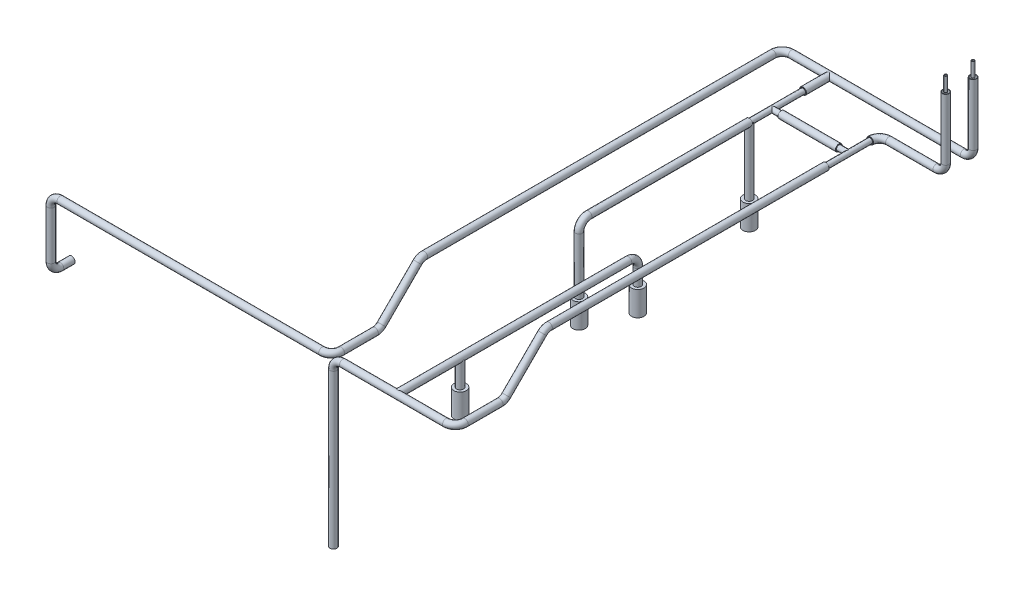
from build123d import *

# Parameters (mm, degrees)
CROQUIS19_R                   = 15
CROQUIS19_R_2                 = 10.25
SALIENTE_EXTRUIR5_DEPTH       = 150
CROQUIS21_R                   = 15
CROQUIS21_R_2                 = 10.25
SALIENTE_EXTRUIR6_DEPTH       = 150
CROQUIS1_R                    = 36.5
CROQUIS1_R_2                  = 31.75
CROQUIS9_R                    = 36.5
CROQUIS9_R_2                  = 31.75
CROQUIS23_R                   = 36.5
CROQUIS23_R_2                 = 31.75
CROQUIS24_R                   = 36.5
CROQUIS24_R_2                 = 31.75
CROQUIS25_R                   = 36.5
CROQUIS25_R_2                 = 31.75
CROQUIS26_R                   = 36.5
CROQUIS26_R_2                 = 31.75
CROQUIS8_R                    = 36.5
CROQUIS8_R_2                  = 31.75
CROQUIS16_R                   = 36.5
CROQUIS16_R_2                 = 31.75
CROQUIS14_R                   = 36.5
CROQUIS14_R_2                 = 31.75
CROQUIS18_R                   = 65.5
SALIENTE_EXTRUIR7_DEPTH       = 260
CROQUIS12_R                   = 65.5
SALIENTE_EXTRUIR8_DEPTH       = 260
CROQUIS13_R                   = 65.5
SALIENTE_EXTRUIR9_DEPTH       = 260
CROQUIS15_R                   = 65.5
SALIENTE_EXTRUIR10_DEPTH      = 260
CROQUIS27_R                   = 27
CROQUIS27_R_2                 = 24
SALIENTE_EXTRUIR12_DEPTH      = 569
CROQUIS28_R                   = 27
CROQUIS28_R_2                 = 24
SALIENTE_EXTRUIR13_DEPTH      = 99
CROQUIS29_R                   = 27
CROQUIS29_R_2                 = 24
SALIENTE_EXTRUIR14_DEPTH      = 469
SALIENTE_EXTRUIR15_DEPTH      = 5
SALIENTE_EXTRUIR15_DEPTH_BACK = 99
CROQUIS30_R                   = 27
CROQUIS30_R_2                 = 24


with BuildPart() as part:
    # Croquis19 → Saliente-Extruir5 (new body)
    with BuildSketch(Plane(origin=(4896.843322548, 3232.90277491, 1187.836422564), x_dir=(-1, 0, 0), z_dir=(0, 1, 0))):
        with Locations(Location((0, 0, 0), (0, 0, 90))):
            Circle(CROQUIS19_R)
        with Locations(Location((0, 0, 0), (0, 0, 90))):
            Circle(CROQUIS19_R_2, mode=Mode.SUBTRACT)
    extrude(amount=SALIENTE_EXTRUIR5_DEPTH)


with BuildPart() as body_2:
    # Croquis21 → Saliente-Extruir6 (new body)
    with BuildSketch(Plane(origin=(4886.843322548, 3232.90277491, 1467.836422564), x_dir=(-1, 0, 0), z_dir=(0, 1, 0))):
        with Locations(Location((0, 0, 0), (0, 0, 90))):
            Circle(CROQUIS21_R)
        with Locations(Location((0, 0, 0), (0, 0, 90))):
            Circle(CROQUIS21_R_2, mode=Mode.SUBTRACT)
    extrude(amount=SALIENTE_EXTRUIR6_DEPTH)


with BuildPart() as body_3:
    # Barrer1: sweep along a curve in space
    with BuildLine() as barrer1_path:
        Line((-93.156677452, 1334.496570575, 5736.242626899), (-93.156677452, 1334.496570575, 5856.242626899))
        ThreePointArc((-93.156677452, 1334.496570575, 5856.242626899), (-93.156677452, 1363.785892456, 5926.953305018), (-93.156677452, 1434.496570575, 5956.242626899))
        Line((-93.156677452, 1434.496570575, 5956.242626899), (-93.156677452, 1944.496570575, 5956.242626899))
        ThreePointArc((-93.156677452, 1944.496570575, 5956.242626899), (-63.867355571, 2015.207248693, 5956.242626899), (6.843322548, 2044.496570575, 5956.242626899))
        Line((6.843322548, 2044.496570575, 5956.242626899), (2776.843322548, 2044.496570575, 5956.242626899))
        ThreePointArc((2876.843322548, 2044.496570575, 5856.242626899), (2847.554000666, 2044.496570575, 5926.953305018), (2776.843322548, 2044.496570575, 5956.242626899))
        Line((2876.843322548, 2044.496570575, 5856.242626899), (2876.843322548, 2044.496570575, 5497.663983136))
        ThreePointArc((2876.843322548, 2044.496570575, 5497.663983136), (2876.843322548, 2052.108617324, 5459.3956399), (2876.843322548, 2073.785892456, 5426.953305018))
        Line((2876.843322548, 2073.785892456, 5426.953305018), (2876.843322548, 2453.613453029, 5047.125744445))
        ThreePointArc((2876.843322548, 2453.613453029, 5047.125744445), (2876.843322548, 2475.290728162, 5014.683409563), (2876.843322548, 2482.90277491, 4976.415066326))
        Line((2876.843322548, 2482.90277491, 4976.415066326), (2876.843322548, 2482.90277491, 1287.836422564))
        ThreePointArc((2876.843322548, 2482.90277491, 1287.836422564), (2906.132644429, 2482.90277491, 1217.125744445), (2976.843322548, 2482.90277491, 1187.836422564))
        Line((2976.843322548, 2482.90277491, 1187.836422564), (3376.843322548, 2482.90277491, 1187.836422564))
        Line((3376.843322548, 2482.90277491, 1187.836422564), (4796.843322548, 2482.90277491, 1187.836422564))
        ThreePointArc((4796.843322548, 2482.90277491, 1187.836422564), (4867.554000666, 2512.192096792, 1187.836422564), (4896.843322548, 2582.90277491, 1187.836422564))
        Line((4896.843322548, 2582.90277491, 1187.836422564), (4896.843322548, 3232.90277491, 1187.836422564))
    # Croquis1 → Barrer1 (sweep)
    with BuildSketch(Plane(origin=(-93.156677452, 1334.496570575, 5736.242626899), x_dir=(1, 0, 0), z_dir=(0, 0, 1))):
        Circle(CROQUIS1_R)
        Circle(CROQUIS1_R_2, mode=Mode.SUBTRACT)
    sweep(path=barrer1_path.line)

    # Barrer4: sweep along a curve in space
    with BuildLine() as barrer4_path:
        Line((3376.843322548, 2482.90277491, 1187.836422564), (3376.843322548, 2482.90277491, 1467.836422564))
    # Croquis24 → Barrer4 (sweep)
    with BuildSketch(Plane(origin=(3376.843322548, 2482.90277491, 1467.836422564), x_dir=(1, 0, 0), z_dir=(0, 0, 1))):
        Circle(CROQUIS24_R)
        Circle(CROQUIS24_R_2, mode=Mode.SUBTRACT)
    sweep(path=barrer4_path.line)


with BuildPart() as body_4:
    # Barrer2: sweep along a curve in space
    with BuildLine() as barrer2_path:
        Line((3376.843322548, 1782.90277491, 3837.836422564), (3376.843322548, 2382.90277491, 3837.836422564))
        ThreePointArc((3376.843322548, 2382.90277491, 3837.836422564), (3376.843322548, 2453.613453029, 3808.547100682), (3376.843322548, 2482.90277491, 3737.836422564))
        Line((3376.843322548, 2482.90277491, 3737.836422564), (3376.843322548, 2482.90277491, 2037.836422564))
    # Croquis9 → Barrer2 (sweep)
    with BuildSketch(Plane(origin=(3376.843322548, 1782.90277491, 3837.836422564), x_dir=(1, 0, 0), z_dir=(0, -1, 0))):
        Circle(CROQUIS9_R)
        Circle(CROQUIS9_R_2, mode=Mode.SUBTRACT)
    sweep(path=barrer2_path.line)

    # Barrer8: sweep along a curve in space
    with BuildLine() as barrer8_path:
        Line((3376.843322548, 2482.90277491, 2037.836422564), (3376.843322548, 1782.90277491, 2037.836422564))
    # Croquis16 → Barrer8 (sweep)
    with BuildSketch(Plane(origin=(3376.843322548, 1782.90277491, 2037.836422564), x_dir=(1, 0, 0), z_dir=(0, -1, 0))):
        Circle(CROQUIS16_R)
        Circle(CROQUIS16_R_2, mode=Mode.SUBTRACT)
    sweep(path=barrer8_path.line)

    # Croquis18 → Saliente-Extruir7 (add)
    with BuildSketch(Plane(origin=(3376.843322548, 1782.90277491, 2037.836422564), x_dir=(1, 0, 0), z_dir=(0, -1, 0))):
        with Locations(Location((0, 0, 0), (0, 0, 270))):
            Circle(CROQUIS18_R)
    extrude(amount=SALIENTE_EXTRUIR7_DEPTH)

    # Croquis13 → Saliente-Extruir9 (add)
    with BuildSketch(Plane(origin=(3376.843322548, 1782.90277491, 3837.836422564), x_dir=(1, 0, 0), z_dir=(0, -1, 0))):
        with Locations(Location((0, 0, 0), (0, 0, 270))):
            Circle(CROQUIS13_R)
    extrude(amount=SALIENTE_EXTRUIR9_DEPTH)

    # Croquis27 → Saliente-Extruir12 (add)
    with BuildSketch(Plane(origin=(3376.843322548, 2482.90277491, 2037.836422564), x_dir=(1, 0, 0), z_dir=(0, 0, 1))):
        Circle(CROQUIS27_R)
        Circle(CROQUIS27_R_2, mode=Mode.SUBTRACT)
    extrude(amount=-SALIENTE_EXTRUIR12_DEPTH)

    # Croquis28 → Saliente-Extruir13 (add)
    with BuildSketch(Plane(origin=(3376.843322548, 2482.90277491, 1797.836422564), x_dir=(0, 0, -1), z_dir=(1, 0, 0))):
        Circle(CROQUIS28_R)
        Circle(CROQUIS28_R_2, mode=Mode.SUBTRACT)
    extrude(amount=SALIENTE_EXTRUIR13_DEPTH)


with BuildPart() as body_5:
    # Barrer3: sweep along a curve in space
    with BuildLine() as barrer3_path:
        Line((2896.843322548, 314.496570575, 5956.242626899), (2896.843322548, 1944.496570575, 5956.242626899))
        ThreePointArc((2896.843322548, 1944.496570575, 5956.242626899), (2926.132644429, 2015.207248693, 5956.242626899), (2996.843322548, 2044.496570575, 5956.242626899))
        Line((2996.843322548, 2044.496570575, 5956.242626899), (4086.843322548, 2044.496570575, 5956.242626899))
        ThreePointArc((4086.843322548, 2044.496570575, 5956.242626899), (4157.554000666, 2044.496570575, 5926.953305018), (4186.843322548, 2044.496570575, 5856.242626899))
        Line((4186.843322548, 2044.496570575, 5856.242626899), (4186.843322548, 2044.496570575, 5487.663983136))
        ThreePointArc((4186.843322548, 2044.496570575, 5487.663983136), (4186.843322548, 2052.108617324, 5449.3956399), (4186.843322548, 2073.785892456, 5416.953305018))
        Line((4186.843322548, 2073.785892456, 5416.953305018), (4186.843322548, 2453.613453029, 5037.125744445))
        ThreePointArc((4186.843322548, 2453.613453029, 5037.125744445), (4186.843322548, 2475.290728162, 5004.683409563), (4186.843322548, 2482.90277491, 4966.415066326))
        Line((4186.843322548, 2482.90277491, 4966.415066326), (4186.843322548, 2482.90277491, 2037.836422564))
    # Croquis23 → Barrer3 (sweep)
    with BuildSketch(Plane(origin=(2896.843322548, 314.496570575, 5956.242626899), x_dir=(1, 0, 0), z_dir=(0, -1, 0))):
        Circle(CROQUIS23_R)
        Circle(CROQUIS23_R_2, mode=Mode.SUBTRACT)
    sweep(path=barrer3_path.line)

    # Barrer7: sweep along a curve in space
    with BuildLine() as barrer7_path:
        Line((3566.843322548, 1774.496570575, 3406.242626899), (3566.843322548, 1944.496570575, 3406.242626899))
        ThreePointArc((3566.843322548, 1944.496570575, 3406.242626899), (3566.843322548, 2015.207248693, 3435.531948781), (3566.843322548, 2044.496570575, 3506.242626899))
        Line((3566.843322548, 2044.496570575, 3506.242626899), (3566.843322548, 2044.496570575, 5956.242626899))
    # Croquis8 → Barrer7 (sweep)
    with BuildSketch(Plane(origin=(3566.843322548, 1774.496570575, 3406.242626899), x_dir=(1, 0, 0), z_dir=(0, -1, 0))):
        Circle(CROQUIS8_R)
        Circle(CROQUIS8_R_2, mode=Mode.SUBTRACT)
    sweep(path=barrer7_path.line)

    # Barrer9: sweep along a curve in space
    with BuildLine() as barrer9_path:
        Line((3566.843322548, 2044.496570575, 5286.242626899), (3566.843322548, 1774.496570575, 5286.242626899))
    # Croquis14 → Barrer9 (sweep)
    with BuildSketch(Plane(origin=(3566.843322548, 1774.496570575, 5286.242626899), x_dir=(1, 0, 0), z_dir=(0, -1, 0))):
        Circle(CROQUIS14_R)
        Circle(CROQUIS14_R_2, mode=Mode.SUBTRACT)
    sweep(path=barrer9_path.line)

    # Croquis12 → Saliente-Extruir8 (add)
    with BuildSketch(Plane(origin=(3566.843322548, 1774.496570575, 3406.242626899), x_dir=(1, 0, 0), z_dir=(0, -1, 0))):
        Circle(CROQUIS12_R)
    extrude(amount=SALIENTE_EXTRUIR8_DEPTH)

    # Croquis15 → Saliente-Extruir10 (add)
    with BuildSketch(Plane(origin=(3566.843322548, 1774.496570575, 5286.242626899), x_dir=(1, 0, 0), z_dir=(0, -1, 0))):
        Circle(CROQUIS15_R)
    extrude(amount=SALIENTE_EXTRUIR10_DEPTH)


with BuildPart() as body_6:
    # Barrer5: sweep along a curve in space
    with BuildLine() as barrer5_path:
        Line((3476.843322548, 2482.90277491, 1797.836422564), (4086.843322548, 2482.90277491, 1797.836422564))
    # Croquis25 → Barrer5 (sweep)
    with BuildSketch(Plane(origin=(3476.843322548, 2482.90277491, 1797.836422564), x_dir=(0, 0, -1), z_dir=(1, 0, 0))):
        Circle(CROQUIS25_R)
        Circle(CROQUIS25_R_2, mode=Mode.SUBTRACT)
    sweep(path=barrer5_path.line)


with BuildPart() as body_7:
    # Barrer6: sweep along a curve in space
    with BuildLine() as barrer6_path:
        Line((4886.843322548, 3232.90277491, 1467.836422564), (4886.843322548, 2582.90277491, 1467.836422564))
        ThreePointArc((4886.843322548, 2582.90277491, 1467.836422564), (4857.554000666, 2512.192096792, 1467.836422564), (4786.843322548, 2482.90277491, 1467.836422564))
        Line((4786.843322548, 2482.90277491, 1467.836422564), (4286.843322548, 2482.90277491, 1467.836422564))
        ThreePointArc((4286.843322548, 2482.90277491, 1467.836422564), (4216.132644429, 2482.90277491, 1497.125744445), (4186.843322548, 2482.90277491, 1567.836422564))
    # Croquis26 → Barrer6 (sweep)
    with BuildSketch(Plane(origin=(4886.843322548, 3232.90277491, 1467.836422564), x_dir=(-1, 0, 0), z_dir=(0, 1, 0))):
        Circle(CROQUIS26_R)
        Circle(CROQUIS26_R_2, mode=Mode.SUBTRACT)
    sweep(path=barrer6_path.line)


with BuildPart() as body_8:
    # Croquis29 → Saliente-Extruir14 (new body)
    with BuildSketch(Plane(origin=(4186.843322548, 2482.90277491, 2037.836422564), x_dir=(1, 0, 0), z_dir=(0, 0, 1))):
        Circle(CROQUIS29_R)
        Circle(CROQUIS29_R_2, mode=Mode.SUBTRACT)
    extrude(amount=-SALIENTE_EXTRUIR14_DEPTH)

    # Croquis30 → Saliente-Extruir15 (add, two sides: drawn at the far end of the back side and taken through both)
    with BuildSketch(Plane(origin=(4186.843322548, 2482.90277491, 1797.836422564), x_dir=(0, 0, -1), z_dir=(1, 0, 0)).offset(-SALIENTE_EXTRUIR15_DEPTH_BACK)):
        with Locations(Location((0, 0, 0), (0, 0, 270))):
            Circle(CROQUIS30_R)
        with Locations(Location((0, 0, 0), (0, 0, 180))):
            Circle(CROQUIS30_R_2, mode=Mode.SUBTRACT)
    extrude(amount=SALIENTE_EXTRUIR15_DEPTH + SALIENTE_EXTRUIR15_DEPTH_BACK)


solid = Compound([part.part, body_2.part, body_3.part, body_4.part, body_5.part, body_6.part, body_7.part, body_8.part])
